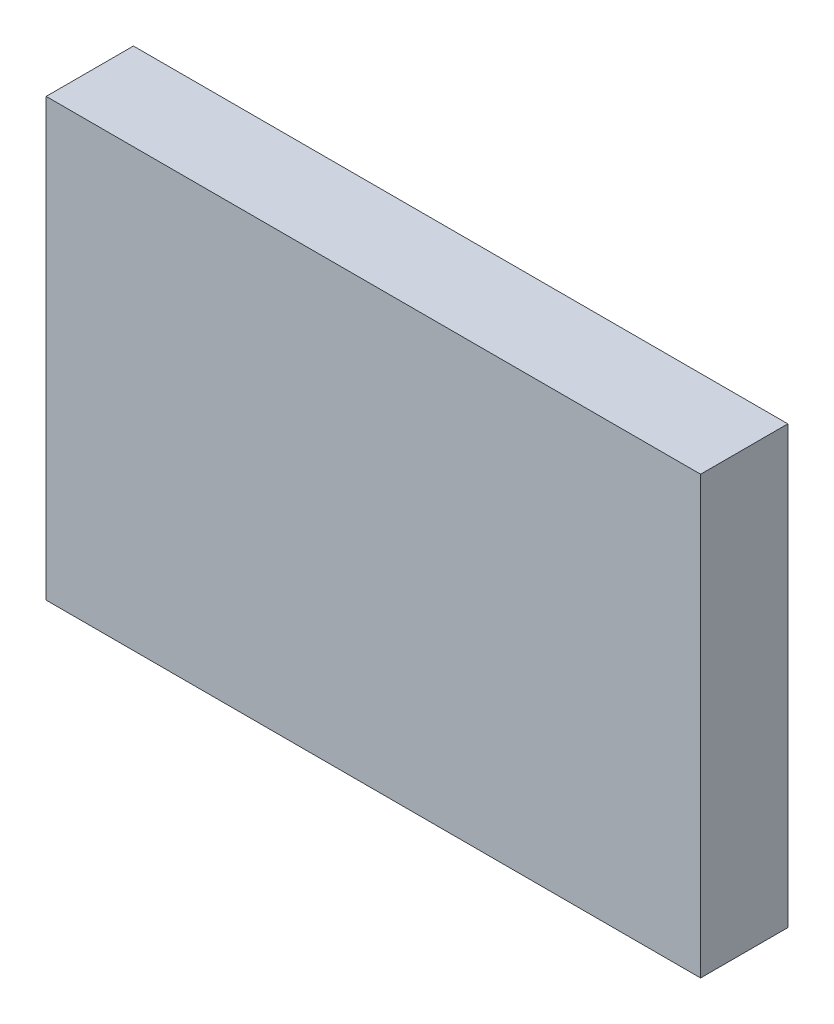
from build123d import *

# Parameters (mm, degrees)
SKETCH_1_W      = 150
SKETCH_1_H      = 100
EXTRUDE_1_DEPTH = 20


with BuildPart() as part:
    # Sketch 1 → Extrude 1 (new body)
    with BuildSketch(Plane.XY):
        Rectangle(SKETCH_1_W, SKETCH_1_H)
    extrude(amount=-EXTRUDE_1_DEPTH)


solid = part.part
